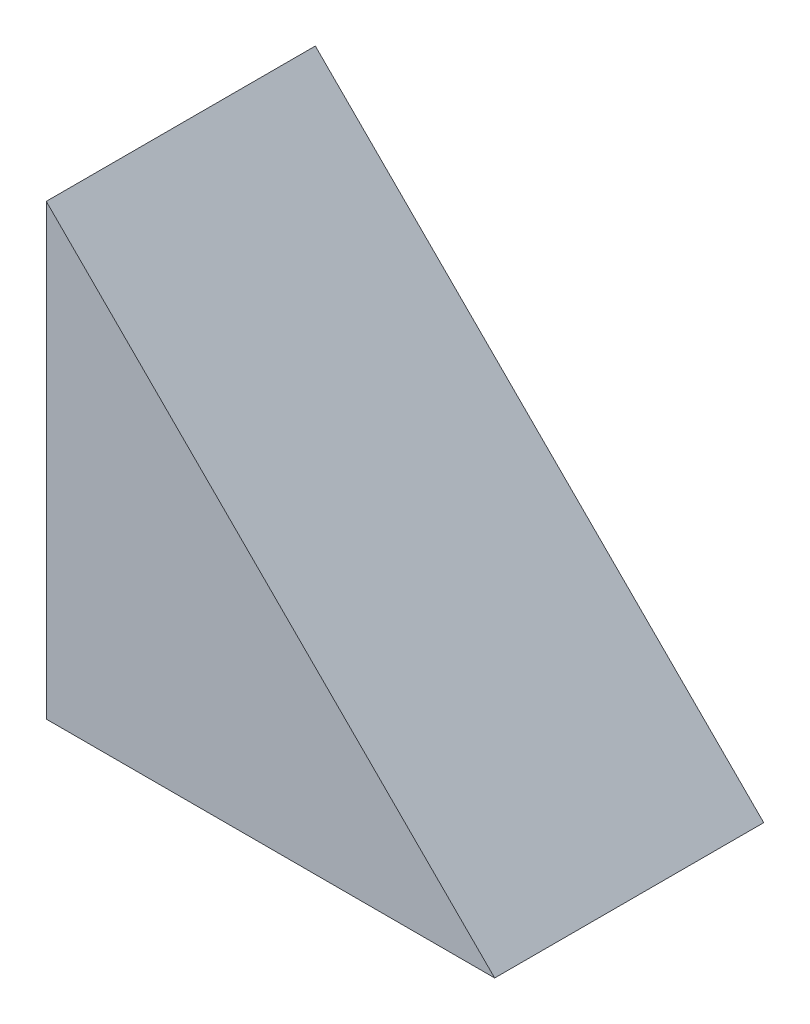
ISO-10303-21;
HEADER;
FILE_DESCRIPTION(('STEP AP214'),'2;1');
FILE_NAME('part.step','',(''),(''),'','','');
FILE_SCHEMA(('AUTOMOTIVE_DESIGN { 1 0 10303 214 1 1 1 1 }'));
ENDSEC;
DATA;
#1=APPLICATION_CONTEXT('core data for automotive mechanical design processes');
#2=APPLICATION_PROTOCOL_DEFINITION('international standard','automotive_design',2000,#1);
#3=PRODUCT_CONTEXT('',#1,'mechanical');
#4=PRODUCT('Part','Part','',(#3));
#5=PRODUCT_RELATED_PRODUCT_CATEGORY('part','',(#4));
#6=PRODUCT_DEFINITION_FORMATION('','',#4);
#7=PRODUCT_DEFINITION_CONTEXT('part definition',#1,'design');
#8=PRODUCT_DEFINITION('design','',#6,#7);
#9=PRODUCT_DEFINITION_SHAPE('','',#8);
#10=(LENGTH_UNIT() NAMED_UNIT(*) SI_UNIT(.MILLI.,.METRE.));
#11=(NAMED_UNIT(*) PLANE_ANGLE_UNIT() SI_UNIT($,.RADIAN.));
#12=(NAMED_UNIT(*) SI_UNIT($,.STERADIAN.) SOLID_ANGLE_UNIT());
#13=UNCERTAINTY_MEASURE_WITH_UNIT(LENGTH_MEASURE(1.E-05),#10,'distance_accuracy_value','');
#14=(GEOMETRIC_REPRESENTATION_CONTEXT(3) GLOBAL_UNCERTAINTY_ASSIGNED_CONTEXT((#13)) GLOBAL_UNIT_ASSIGNED_CONTEXT((#10,
#11,#12)) REPRESENTATION_CONTEXT('',''));
#15=CARTESIAN_POINT('',(0.,0.,0.));
#16=DIRECTION('',(0.,0.,1.));
#17=DIRECTION('',(1.,0.,0.));
#18=AXIS2_PLACEMENT_3D('',#15,#16,#17);
#19=CARTESIAN_POINT('',(0.,0.,12.));
#20=DIRECTION('',(-1.,0.,0.));
#21=DIRECTION('',(0.,-1.,0.));
#22=AXIS2_PLACEMENT_3D('',#19,#20,#21);
#23=PLANE('',#22);
#24=DIRECTION('',(0.,1.,0.));
#25=VECTOR('',#24,1.);
#26=CARTESIAN_POINT('',(0.,0.,0.));
#27=LINE('',#26,#25);
#28=CARTESIAN_POINT('',(0.,0.,0.));
#29=VERTEX_POINT('',#28);
#30=CARTESIAN_POINT('',(0.,20.,0.));
#31=VERTEX_POINT('',#30);
#32=EDGE_CURVE('E71',#29,#31,#27,.T.);
#33=ORIENTED_EDGE('',*,*,#32,.F.);
#34=DIRECTION('',(0.,0.,-1.));
#35=VECTOR('',#34,1.);
#36=CARTESIAN_POINT('',(0.,0.,12.));
#37=LINE('',#36,#35);
#38=CARTESIAN_POINT('',(0.,0.,12.));
#39=VERTEX_POINT('',#38);
#40=EDGE_CURVE('E11',#39,#29,#37,.T.);
#41=ORIENTED_EDGE('',*,*,#40,.F.);
#42=DIRECTION('',(0.,1.,0.));
#43=VECTOR('',#42,1.);
#44=CARTESIAN_POINT('',(0.,0.,12.));
#45=LINE('',#44,#43);
#46=CARTESIAN_POINT('',(0.,20.,12.));
#47=VERTEX_POINT('',#46);
#48=EDGE_CURVE('E69',#39,#47,#45,.T.);
#49=ORIENTED_EDGE('',*,*,#48,.T.);
#50=DIRECTION('',(0.,0.,-1.));
#51=VECTOR('',#50,1.);
#52=CARTESIAN_POINT('',(0.,20.,12.));
#53=LINE('',#52,#51);
#54=EDGE_CURVE('E51',#47,#31,#53,.T.);
#55=ORIENTED_EDGE('',*,*,#54,.T.);
#56=EDGE_LOOP('',(#33,#41,#49,#55));
#57=FACE_BOUND('',#56,.T.);
#58=ADVANCED_FACE('F35',(#57),#23,.T.);
#59=CARTESIAN_POINT('',(0.,0.,12.));
#60=DIRECTION('',(0.,1.,0.));
#61=DIRECTION('',(0.,0.,1.));
#62=AXIS2_PLACEMENT_3D('',#59,#60,#61);
#63=PLANE('',#62);
#64=DIRECTION('',(1.,0.,0.));
#65=VECTOR('',#64,1.);
#66=CARTESIAN_POINT('',(0.,0.,0.));
#67=LINE('',#66,#65);
#68=CARTESIAN_POINT('',(20.,0.,0.));
#69=VERTEX_POINT('',#68);
#70=EDGE_CURVE('E83',#29,#69,#67,.T.);
#71=ORIENTED_EDGE('',*,*,#70,.T.);
#72=DIRECTION('',(0.,0.,-1.));
#73=VECTOR('',#72,1.);
#74=CARTESIAN_POINT('',(20.,0.,12.));
#75=LINE('',#74,#73);
#76=CARTESIAN_POINT('',(20.,0.,12.));
#77=VERTEX_POINT('',#76);
#78=EDGE_CURVE('E43',#77,#69,#75,.T.);
#79=ORIENTED_EDGE('',*,*,#78,.F.);
#80=DIRECTION('',(1.,0.,0.));
#81=VECTOR('',#80,1.);
#82=CARTESIAN_POINT('',(0.,0.,12.));
#83=LINE('',#82,#81);
#84=EDGE_CURVE('E74',#39,#77,#83,.T.);
#85=ORIENTED_EDGE('',*,*,#84,.F.);
#86=ORIENTED_EDGE('',*,*,#40,.T.);
#87=EDGE_LOOP('',(#71,#79,#85,#86));
#88=FACE_BOUND('',#87,.T.);
#89=ADVANCED_FACE('F75',(#88),#63,.F.);
#90=CARTESIAN_POINT('',(10.,10.,12.));
#91=DIRECTION('',(0.707106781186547,0.707106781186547,0.));
#92=DIRECTION('',(-0.707106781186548,0.707106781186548,0.));
#93=AXIS2_PLACEMENT_3D('',#90,#91,#92);
#94=PLANE('',#93);
#95=DIRECTION('',(0.707106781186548,-0.707106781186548,0.));
#96=VECTOR('',#95,1.);
#97=CARTESIAN_POINT('',(10.,10.,0.));
#98=LINE('',#97,#96);
#99=EDGE_CURVE('E80',#31,#69,#98,.T.);
#100=ORIENTED_EDGE('',*,*,#99,.F.);
#101=ORIENTED_EDGE('',*,*,#54,.F.);
#102=DIRECTION('',(0.707106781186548,-0.707106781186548,0.));
#103=VECTOR('',#102,1.);
#104=CARTESIAN_POINT('',(10.,10.,12.));
#105=LINE('',#104,#103);
#106=EDGE_CURVE('E77',#47,#77,#105,.T.);
#107=ORIENTED_EDGE('',*,*,#106,.T.);
#108=ORIENTED_EDGE('',*,*,#78,.T.);
#109=EDGE_LOOP('',(#100,#101,#107,#108));
#110=FACE_BOUND('',#109,.T.);
#111=ADVANCED_FACE('F91',(#110),#94,.T.);
#112=CARTESIAN_POINT('',(0.,0.,12.));
#113=DIRECTION('',(0.,0.,1.));
#114=DIRECTION('',(1.,0.,0.));
#115=AXIS2_PLACEMENT_3D('',#112,#113,#114);
#116=PLANE('',#115);
#117=ORIENTED_EDGE('',*,*,#48,.F.);
#118=ORIENTED_EDGE('',*,*,#84,.T.);
#119=ORIENTED_EDGE('',*,*,#106,.F.);
#120=EDGE_LOOP('',(#117,#118,#119));
#121=FACE_BOUND('',#120,.T.);
#122=ADVANCED_FACE('F79',(#121),#116,.T.);
#123=CARTESIAN_POINT('',(0.,0.,0.));
#124=DIRECTION('',(0.,0.,1.));
#125=DIRECTION('',(1.,0.,0.));
#126=AXIS2_PLACEMENT_3D('',#123,#124,#125);
#127=PLANE('',#126);
#128=ORIENTED_EDGE('',*,*,#32,.T.);
#129=ORIENTED_EDGE('',*,*,#99,.T.);
#130=ORIENTED_EDGE('',*,*,#70,.F.);
#131=EDGE_LOOP('',(#128,#129,#130));
#132=FACE_BOUND('',#131,.T.);
#133=ADVANCED_FACE('F90',(#132),#127,.F.);
#134=CLOSED_SHELL('',(#58,#89,#111,#122,#133));
#135=MANIFOLD_SOLID_BREP('B2',#134);
#136=ADVANCED_BREP_SHAPE_REPRESENTATION('',(#18,#135),#14);
#137=SHAPE_DEFINITION_REPRESENTATION(#9,#136);
ENDSEC;
END-ISO-10303-21;
